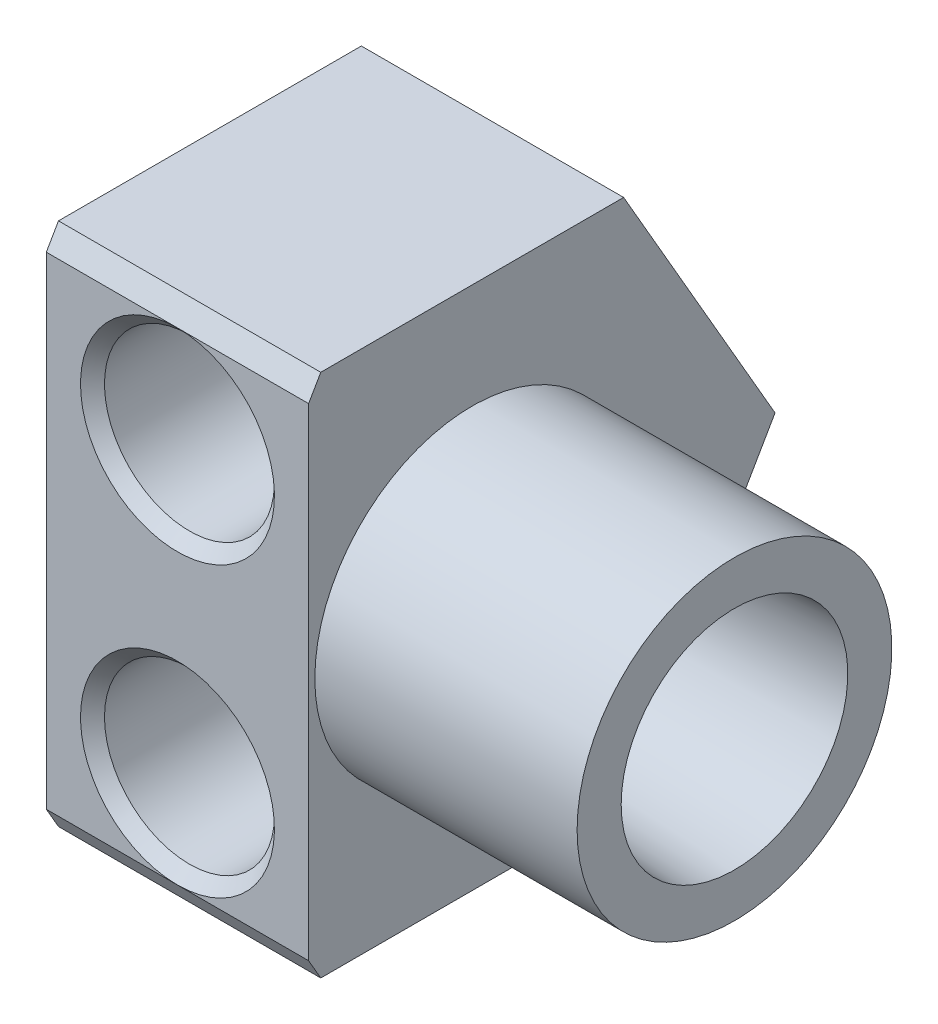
ISO-10303-21;
HEADER;
FILE_DESCRIPTION(('STEP AP214'),'2;1');
FILE_NAME('part.step','',(''),(''),'','','');
FILE_SCHEMA(('AUTOMOTIVE_DESIGN { 1 0 10303 214 1 1 1 1 }'));
ENDSEC;
DATA;
#1=APPLICATION_CONTEXT('core data for automotive mechanical design processes');
#2=APPLICATION_PROTOCOL_DEFINITION('international standard','automotive_design',2000,#1);
#3=PRODUCT_CONTEXT('',#1,'mechanical');
#4=PRODUCT('Part','Part','',(#3));
#5=PRODUCT_RELATED_PRODUCT_CATEGORY('part','',(#4));
#6=PRODUCT_DEFINITION_FORMATION('','',#4);
#7=PRODUCT_DEFINITION_CONTEXT('part definition',#1,'design');
#8=PRODUCT_DEFINITION('design','',#6,#7);
#9=PRODUCT_DEFINITION_SHAPE('','',#8);
#10=(LENGTH_UNIT() NAMED_UNIT(*) SI_UNIT(.MILLI.,.METRE.));
#11=(NAMED_UNIT(*) PLANE_ANGLE_UNIT() SI_UNIT($,.RADIAN.));
#12=(NAMED_UNIT(*) SI_UNIT($,.STERADIAN.) SOLID_ANGLE_UNIT());
#13=UNCERTAINTY_MEASURE_WITH_UNIT(LENGTH_MEASURE(1.E-05),#10,'distance_accuracy_value','');
#14=(GEOMETRIC_REPRESENTATION_CONTEXT(3) GLOBAL_UNCERTAINTY_ASSIGNED_CONTEXT((#13)) GLOBAL_UNIT_ASSIGNED_CONTEXT((#10,
#11,#12)) REPRESENTATION_CONTEXT('',''));
#15=CARTESIAN_POINT('',(0.,0.,0.));
#16=DIRECTION('',(0.,0.,1.));
#17=DIRECTION('',(1.,0.,0.));
#18=AXIS2_PLACEMENT_3D('',#15,#16,#17);
#19=CARTESIAN_POINT('',(21.4376,0.,0.));
#20=DIRECTION('',(1.,0.,0.));
#21=DIRECTION('',(0.,0.,-1.));
#22=AXIS2_PLACEMENT_3D('',#19,#20,#21);
#23=PLANE('',#22);
#24=CARTESIAN_POINT('',(21.4376,0.,0.));
#25=DIRECTION('',(-1.,0.,0.));
#26=DIRECTION('',(0.,0.,1.));
#27=AXIS2_PLACEMENT_3D('',#24,#25,#26);
#28=CIRCLE('',#27,6.31755001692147);
#29=CARTESIAN_POINT('',(21.4376,0.,6.31755001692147));
#30=VERTEX_POINT('',#29);
#31=EDGE_CURVE('E36',#30,#30,#28,.T.);
#32=ORIENTED_EDGE('',*,*,#31,.F.);
#33=EDGE_LOOP('',(#32));
#34=FACE_BOUND('',#33,.T.);
#35=ADVANCED_FACE('F16',(#34),#23,.T.);
#36=CARTESIAN_POINT('',(0.,0.,-4.19801849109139));
#37=DIRECTION('',(0.,0.,1.));
#38=DIRECTION('',(1.,0.,0.));
#39=AXIS2_PLACEMENT_3D('',#36,#37,#38);
#40=PLANE('',#39);
#41=CARTESIAN_POINT('',(7.9375,8.73125,-4.19801849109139));
#42=DIRECTION('',(0.,0.,-1.));
#43=DIRECTION('',(0.,1.,0.));
#44=AXIS2_PLACEMENT_3D('',#41,#42,#43);
#45=CIRCLE('',#44,5.1435);
#46=CARTESIAN_POINT('',(7.9375,13.87475,-4.19801849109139));
#47=VERTEX_POINT('',#46);
#48=EDGE_CURVE('E154',#47,#47,#45,.T.);
#49=ORIENTED_EDGE('',*,*,#48,.F.);
#50=EDGE_LOOP('',(#49));
#51=FACE_BOUND('',#50,.T.);
#52=ADVANCED_FACE('F304',(#51),#40,.T.);
#53=CARTESIAN_POINT('',(5.95591568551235,3.77932766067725,1.73070681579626));
#54=CARTESIAN_POINT('',(6.74855047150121,3.63087026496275,1.73070619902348));
#55=CARTESIAN_POINT('',(7.54118525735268,3.53577356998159,1.73070536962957));
#56=CARTESIAN_POINT('',(8.33382004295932,3.53577439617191,1.73070416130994));
#57=CARTESIAN_POINT('',(9.12645482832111,3.6308718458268,1.73070257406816));
#58=CARTESIAN_POINT('',(9.91908961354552,3.77932968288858,1.73070077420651));
#59=CARTESIAN_POINT('',(5.95591462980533,3.92681016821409,1.03842961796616));
#60=CARTESIAN_POINT('',(6.74854941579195,3.77922035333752,1.03842899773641));
#61=CARTESIAN_POINT('',(7.54118420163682,3.68668609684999,1.0384281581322));
#62=CARTESIAN_POINT('',(8.33381898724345,3.68668661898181,1.03842694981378));
#63=CARTESIAN_POINT('',(9.12645377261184,3.77922156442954,1.03842537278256));
#64=CARTESIAN_POINT('',(9.91908855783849,3.92681155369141,1.03842357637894));
#65=CARTESIAN_POINT('',(5.95591357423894,4.01966553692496,0.346152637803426));
#66=CARTESIAN_POINT('',(6.74854836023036,3.87021078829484,0.346152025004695));
#67=CARTESIAN_POINT('',(7.54118314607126,3.77921913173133,0.346151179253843));
#68=CARTESIAN_POINT('',(8.3338179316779,3.77921911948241,0.346149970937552));
#69=CARTESIAN_POINT('',(9.12645271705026,3.87021114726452,0.346148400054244));
#70=CARTESIAN_POINT('',(9.9190875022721,4.01966636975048,0.346146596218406));
#71=CARTESIAN_POINT('',(5.95591251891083,4.01996875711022,-0.346123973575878));
#72=CARTESIAN_POINT('',(6.74854730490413,3.8697851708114,-0.346124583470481));
#73=CARTESIAN_POINT('',(7.54118209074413,3.77914553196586,-0.346125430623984));
#74=CARTESIAN_POINT('',(8.33381687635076,3.77914577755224,-0.346126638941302));
#75=CARTESIAN_POINT('',(9.12645166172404,3.86978449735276,-0.346128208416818));
#76=CARTESIAN_POINT('',(9.91908644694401,4.01996800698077,-0.346130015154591));
#77=CARTESIAN_POINT('',(5.95591146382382,3.92663167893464,-1.03840021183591));
#78=CARTESIAN_POINT('',(6.74854624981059,3.77898481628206,-1.03840083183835));
#79=CARTESIAN_POINT('',(7.5411810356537,3.68713374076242,-1.03840167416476));
#80=CARTESIAN_POINT('',(8.33381582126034,3.6871334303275,-1.03840288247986));
#81=CARTESIAN_POINT('',(9.12645060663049,3.77898388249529,-1.03840445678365));
#82=CARTESIAN_POINT('',(9.91908539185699,3.92663012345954,-1.03840625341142));
#83=CARTESIAN_POINT('',(5.95591040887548,3.77943158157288,-1.73067623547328));
#84=CARTESIAN_POINT('',(6.74854519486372,3.63121310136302,-1.73067685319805));
#85=CARTESIAN_POINT('',(7.54117998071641,3.53564380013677,-1.73067768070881));
#86=CARTESIAN_POINT('',(8.33381476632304,3.53564268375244,-1.7306788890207));
#87=CARTESIAN_POINT('',(9.12644955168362,3.63121167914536,-1.7306804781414));
#88=CARTESIAN_POINT('',(9.91908433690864,3.77942957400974,-1.73068227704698));
#89=CARTESIAN_POINT('',(5.955910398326,3.77795958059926,-1.73759899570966));
#90=CARTESIAN_POINT('',(6.74854518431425,3.62973538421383,-1.73759961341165));
#91=CARTESIAN_POINT('',(7.54117997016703,3.53412890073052,-1.73760044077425));
#92=CARTESIAN_POINT('',(8.33381475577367,3.53412777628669,-1.73760164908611));
#93=CARTESIAN_POINT('',(9.12644954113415,3.62973395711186,-1.73760323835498));
#94=CARTESIAN_POINT('',(9.91908432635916,3.77795756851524,-1.73760503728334));
#95=CARTESIAN_POINT('',(5.95591038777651,3.77648757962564,-1.74452175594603));
#96=CARTESIAN_POINT('',(6.74854517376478,3.62825766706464,-1.74452237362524));
#97=CARTESIAN_POINT('',(7.54117995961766,3.53261400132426,-1.74452320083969));
#98=CARTESIAN_POINT('',(8.3338147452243,3.53261286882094,-1.74452440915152));
#99=CARTESIAN_POINT('',(9.12644953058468,3.62825623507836,-1.74452599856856));
#100=CARTESIAN_POINT('',(9.91908431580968,3.77648556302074,-1.74452779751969));
#101=CARTESIAN_POINT('',(5.95591037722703,3.77501557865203,-1.75144451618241));
#102=CARTESIAN_POINT('',(6.74854516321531,3.62677994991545,-1.75144513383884));
#103=CARTESIAN_POINT('',(7.54117994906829,3.53109910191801,-1.75144596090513));
#104=CARTESIAN_POINT('',(8.33381473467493,3.53109796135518,-1.75144716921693));
#105=CARTESIAN_POINT('',(9.12644952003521,3.62677851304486,-1.75144875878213));
#106=CARTESIAN_POINT('',(9.9190843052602,3.77501355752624,-1.75145055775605));
#107=CARTESIAN_POINT('',(5.95591036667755,3.77354357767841,-1.75836727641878));
#108=CARTESIAN_POINT('',(6.74854515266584,3.62530223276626,-1.75836789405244));
#109=CARTESIAN_POINT('',(7.54117993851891,3.52958420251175,-1.75836872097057));
#110=CARTESIAN_POINT('',(8.33381472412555,3.52958305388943,-1.75836992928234));
#111=CARTESIAN_POINT('',(9.12644950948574,3.62530079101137,-1.75837151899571));
#112=CARTESIAN_POINT('',(9.91908429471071,3.77354155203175,-1.75837331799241));
#113=CARTESIAN_POINT('',(5.95591035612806,3.77207157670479,-1.76529003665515));
#114=CARTESIAN_POINT('',(6.74854514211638,3.62382451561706,-1.76529065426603));
#115=CARTESIAN_POINT('',(7.54117992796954,3.52806930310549,-1.76529148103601));
#116=CARTESIAN_POINT('',(8.33381471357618,3.52806814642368,-1.76529268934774));
#117=CARTESIAN_POINT('',(9.12644949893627,3.62382306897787,-1.76529427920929));
#118=CARTESIAN_POINT('',(9.91908428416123,3.77206954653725,-1.76529607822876));
#119=B_SPLINE_SURFACE_WITH_KNOTS('',5,5,((#53,#54,#55,#56,#57,#58),(#59,#60,#61,#62,#63,#64),
(#65,#66,#67,#68,#69,#70),(#71,#72,#73,#74,#75,#76),(#77,#78,#79,#80,#81,#82),(#83,#84,#85,#86,
#87,#88),(#89,#90,#91,#92,#93,#94),(#95,#96,#97,#98,#99,#100),(#101,#102,#103,#104,#105,#106),
(#107,#108,#109,#110,#111,#112),(#113,#114,#115,#116,#117,#118)),.UNSPECIFIED.,.F.,.F.,.F.,(6,5,
6),(6,6),(-1.73070258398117,1.73068046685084,1.76529429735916),(-1.98158674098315,
1.98158718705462),.UNSPECIFIED.);
#120=CARTESIAN_POINT('',(7.93749999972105,3.58774999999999,1.69796964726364));
#121=CARTESIAN_POINT('',(7.8276041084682,3.58775328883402,1.69797085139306));
#122=CARTESIAN_POINT('',(7.71759706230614,3.59129903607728,1.69062056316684));
#123=CARTESIAN_POINT('',(7.49990137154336,3.60523482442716,1.66094505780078));
#124=CARTESIAN_POINT('',(7.39221704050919,3.61563662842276,1.63859410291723));
#125=CARTESIAN_POINT('',(7.18174427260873,3.64246886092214,1.57821239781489));
#126=CARTESIAN_POINT('',(7.07896914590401,3.65891473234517,1.54014145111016));
#127=CARTESIAN_POINT('',(6.88183063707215,3.69625097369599,1.44783662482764));
#128=CARTESIAN_POINT('',(6.78746213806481,3.71713861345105,1.39361266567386));
#129=CARTESIAN_POINT('',(6.61021098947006,3.76111275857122,1.26899342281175));
#130=CARTESIAN_POINT('',(6.52735756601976,3.78420461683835,1.19855815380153));
#131=CARTESIAN_POINT('',(6.37674543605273,3.82963354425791,1.04278225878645));
#132=CARTESIAN_POINT('',(6.30898278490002,3.85197080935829,0.957445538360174));
#133=CARTESIAN_POINT('',(6.19806609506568,3.89048201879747,0.784412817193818));
#134=CARTESIAN_POINT('',(6.1530198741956,3.90706430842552,0.698020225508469));
#135=CARTESIAN_POINT('',(6.07911099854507,3.93504726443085,0.517804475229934));
#136=CARTESIAN_POINT('',(6.0502333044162,3.94645274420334,0.42398831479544));
#137=CARTESIAN_POINT('',(6.01198385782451,3.96172570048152,0.241385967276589));
#138=CARTESIAN_POINT('',(6.00099866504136,3.96621439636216,0.152988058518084));
#139=CARTESIAN_POINT('',(5.99386589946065,3.96911823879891,-0.024488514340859));
#140=CARTESIAN_POINT('',(5.99771203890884,3.96753595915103,-0.113566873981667));
#141=CARTESIAN_POINT('',(6.01940420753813,3.95876439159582,-0.28442375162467));
#142=CARTESIAN_POINT('',(6.03642641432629,3.95190518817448,-0.366326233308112));
#143=CARTESIAN_POINT('',(6.08279743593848,3.93372086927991,-0.526033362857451));
#144=CARTESIAN_POINT('',(6.11214824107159,3.92239503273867,-0.603837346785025));
#145=CARTESIAN_POINT('',(6.18319986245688,3.89601548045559,-0.755729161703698));
#146=CARTESIAN_POINT('',(6.22523661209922,3.88086246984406,-0.829641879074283));
#147=CARTESIAN_POINT('',(6.32001345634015,3.84843998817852,-0.969713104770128));
#148=CARTESIAN_POINT('',(6.37275597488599,3.83117003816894,-1.03586985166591));
#149=CARTESIAN_POINT('',(6.4923307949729,3.79452080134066,-1.16447822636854));
#150=CARTESIAN_POINT('',(6.55997055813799,3.77508560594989,-1.22616283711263));
#151=CARTESIAN_POINT('',(6.70423875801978,3.73723143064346,-1.33827031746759));
#152=CARTESIAN_POINT('',(6.78086963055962,3.71881272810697,-1.38869012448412));
#153=CARTESIAN_POINT('',(6.9482772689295,3.68298479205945,-1.48192977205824));
#154=CARTESIAN_POINT('',(7.03970619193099,3.66581278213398,-1.52366809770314));
#155=CARTESIAN_POINT('',(7.22829588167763,3.635982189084,-1.59358427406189));
#156=CARTESIAN_POINT('',(7.32545976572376,3.62332608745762,-1.62175467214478));
#157=CARTESIAN_POINT('',(7.53409392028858,3.60240906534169,-1.66742291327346));
#158=CARTESIAN_POINT('',(7.64596060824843,3.59478637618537,-1.68340210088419));
#159=CARTESIAN_POINT('',(7.87112661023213,3.58694188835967,-1.69983389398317));
#160=CARTESIAN_POINT('',(7.98442692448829,3.58672557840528,-1.70027498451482));
#161=CARTESIAN_POINT('',(8.22057273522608,3.59406349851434,-1.68492825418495));
#162=CARTESIAN_POINT('',(8.34330041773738,3.60235923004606,-1.66759189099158));
#163=CARTESIAN_POINT('',(8.58359171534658,3.627062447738,-1.61353095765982));
#164=CARTESIAN_POINT('',(8.701157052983,3.64346720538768,-1.57681290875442));
#165=CARTESIAN_POINT('',(8.92316704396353,3.68186119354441,-1.48464081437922));
#166=CARTESIAN_POINT('',(9.02791610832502,3.70364894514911,-1.42984290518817));
#167=CARTESIAN_POINT('',(9.22431107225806,3.75029671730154,-1.30127494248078));
#168=CARTESIAN_POINT('',(9.31596623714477,3.77515454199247,-1.22751840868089));
#169=CARTESIAN_POINT('',(9.47205670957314,3.82140582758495,-1.07240096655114));
#170=CARTESIAN_POINT('',(9.53843847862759,3.84285710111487,-0.993014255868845));
#171=CARTESIAN_POINT('',(9.65526337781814,3.88267278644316,-0.822562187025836));
#172=CARTESIAN_POINT('',(9.70571738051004,3.90103929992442,-0.731504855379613));
#173=CARTESIAN_POINT('',(9.78404095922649,3.93047374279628,-0.550547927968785));
#174=CARTESIAN_POINT('',(9.81372048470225,3.94210405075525,-0.461522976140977));
#175=CARTESIAN_POINT('',(9.85710455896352,3.95932481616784,-0.279124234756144));
#176=CARTESIAN_POINT('',(9.87082305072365,3.96492054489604,-0.18575431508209));
#177=CARTESIAN_POINT('',(9.88114399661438,3.96912222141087,-0.00631740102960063));
#178=CARTESIAN_POINT('',(9.87916489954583,3.96830748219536,0.0796575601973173));
#179=CARTESIAN_POINT('',(9.861523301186,3.96115398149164,0.249950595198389));
#180=CARTESIAN_POINT('',(9.84586142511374,3.95481547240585,0.334268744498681));
#181=CARTESIAN_POINT('',(9.80197601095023,3.93751904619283,0.497113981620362));
#182=CARTESIAN_POINT('',(9.77402387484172,3.92666119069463,0.575725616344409));
#183=CARTESIAN_POINT('',(9.70659765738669,3.90142848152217,0.72721938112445));
#184=CARTESIAN_POINT('',(9.66712131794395,3.88705293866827,0.800100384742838));
#185=CARTESIAN_POINT('',(9.575112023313,3.8551530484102,0.942835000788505));
#186=CARTESIAN_POINT('',(9.521936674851,3.83749133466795,1.0122430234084));
#187=CARTESIAN_POINT('',(9.40548599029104,3.80130850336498,1.14169326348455));
#188=CARTESIAN_POINT('',(9.3422092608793,3.78278726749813,1.20173418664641));
#189=CARTESIAN_POINT('',(9.20141406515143,3.74488246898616,1.31639044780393));
#190=CARTESIAN_POINT('',(9.12313913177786,3.7255615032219,1.37009665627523));
#191=CARTESIAN_POINT('',(8.95884795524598,3.68947229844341,1.46515712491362));
#192=CARTESIAN_POINT('',(8.87282518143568,3.6727062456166,1.50650083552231));
#193=CARTESIAN_POINT('',(8.68636540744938,3.64159432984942,1.58045539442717));
#194=CARTESIAN_POINT('',(8.58534857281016,3.62766092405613,1.61177134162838));
#195=CARTESIAN_POINT('',(8.37944973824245,3.605728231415,1.66003081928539));
#196=CARTESIAN_POINT('',(8.27457266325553,3.59772164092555,1.67699204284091));
#197=CARTESIAN_POINT('',(8.13054403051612,3.59122872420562,1.69067889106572));
#198=CARTESIAN_POINT('',(8.0919995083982,3.58992600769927,1.69341388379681));
#199=CARTESIAN_POINT('',(8.01480790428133,3.58818609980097,1.69705898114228));
#200=CARTESIAN_POINT('',(7.97616083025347,3.58774884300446,1.69796922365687));
#201=CARTESIAN_POINT('',(7.93749999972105,3.58774999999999,1.69796964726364));
#202=B_SPLINE_CURVE_WITH_KNOTS('',3,(#120,#121,#122,#123,#124,#125,#126,#127,#128,#129,#130,
#131,#132,#133,#134,#135,#136,#137,#138,#139,#140,#141,#142,#143,#144,#145,#146,#147,#148,#149,
#150,#151,#152,#153,#154,#155,#156,#157,#158,#159,#160,#161,#162,#163,#164,#165,#166,#167,#168,
#169,#170,#171,#172,#173,#174,#175,#176,#177,#178,#179,#180,#181,#182,#183,#184,#185,#186,#187,
#188,#189,#190,#191,#192,#193,#194,#195,#196,#197,#198,#199,#200,#201),.UNSPECIFIED.,.T.,.F.,(4,
2,2,2,2,2,2,2,2,2,2,2,2,2,2,2,2,2,2,2,2,2,2,2,2,2,2,2,2,2,2,2,2,2,2,2,2,2,2,2,4),(0.,
0.329572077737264,0.65971107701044,0.990699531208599,1.32148512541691,1.6530955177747,
1.98461912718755,2.27949803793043,2.5741022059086,2.8402763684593,3.10633769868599,
3.35698790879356,3.60767859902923,3.86569744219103,4.12377476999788,4.40333812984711,
4.68297740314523,4.98760135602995,5.29239244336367,5.63077940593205,5.96941713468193,
6.34028388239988,6.7110259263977,7.06957094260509,7.4278609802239,7.7431621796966,
8.05824768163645,8.34038457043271,8.62227480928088,8.87900407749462,9.13572161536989,
9.3870344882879,9.63839663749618,9.90487410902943,10.1713883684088,10.4607969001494,
10.7504516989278,11.0692111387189,11.3875771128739,11.5035277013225,11.6194695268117),.UNSPECIFIED.);
#203=CARTESIAN_POINT('',(7.93749999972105,3.58775,1.69796964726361));
#204=VERTEX_POINT('',#203);
#205=EDGE_CURVE('E19',#204,#204,#202,.T.);
#206=ORIENTED_EDGE('',*,*,#205,.F.);
#207=EDGE_LOOP('',(#206));
#208=FACE_BOUND('',#207,.T.);
#209=ADVANCED_FACE('F299',(#208),#119,.F.);
#210=CARTESIAN_POINT('',(0.,0.,-4.1980184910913));
#211=DIRECTION('',(0.,0.,1.));
#212=DIRECTION('',(1.,0.,0.));
#213=AXIS2_PLACEMENT_3D('',#210,#211,#212);
#214=PLANE('',#213);
#215=CARTESIAN_POINT('',(7.9375,-8.73125,-4.1980184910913));
#216=DIRECTION('',(0.,0.,-1.));
#217=DIRECTION('',(0.,1.,0.));
#218=AXIS2_PLACEMENT_3D('',#215,#216,#217);
#219=CIRCLE('',#218,5.14349999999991);
#220=CARTESIAN_POINT('',(7.9375,-3.58775000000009,-4.1980184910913));
#221=VERTEX_POINT('',#220);
#222=EDGE_CURVE('E30',#221,#221,#219,.T.);
#223=ORIENTED_EDGE('',*,*,#222,.F.);
#224=EDGE_LOOP('',(#223));
#225=FACE_BOUND('',#224,.T.);
#226=ADVANCED_FACE('F263',(#225),#214,.T.);
#227=CARTESIAN_POINT('',(5.9559156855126,-3.77932766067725,1.73070681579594));
#228=CARTESIAN_POINT('',(6.74855047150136,-3.63087026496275,1.73070619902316));
#229=CARTESIAN_POINT('',(7.54118525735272,-3.53577356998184,1.73070536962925));
#230=CARTESIAN_POINT('',(8.33382004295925,-3.53577439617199,1.73070416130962));
#231=CARTESIAN_POINT('',(9.12645482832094,-3.63087184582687,1.73070257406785));
#232=CARTESIAN_POINT('',(9.91908961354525,-3.77932968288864,1.73070077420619));
#233=CARTESIAN_POINT('',(5.95591462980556,-3.92681016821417,1.03842961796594));
#234=CARTESIAN_POINT('',(6.74854941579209,-3.77922035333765,1.03842899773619));
#235=CARTESIAN_POINT('',(7.54118420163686,-3.68668609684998,1.03842815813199));
#236=CARTESIAN_POINT('',(8.33381898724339,-3.68668661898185,1.03842694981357));
#237=CARTESIAN_POINT('',(9.12645377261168,-3.77922156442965,1.03842537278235));
#238=CARTESIAN_POINT('',(9.91908855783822,-3.92681155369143,1.03842357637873));
#239=CARTESIAN_POINT('',(5.95591357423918,-4.0196655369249,0.346152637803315));
#240=CARTESIAN_POINT('',(6.7485483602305,-3.87021078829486,0.346152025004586));
#241=CARTESIAN_POINT('',(7.5411831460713,-3.77921913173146,0.346151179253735));
#242=CARTESIAN_POINT('',(8.33381793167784,-3.77921911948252,0.346149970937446));
#243=CARTESIAN_POINT('',(9.1264527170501,-3.87021114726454,0.346148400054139));
#244=CARTESIAN_POINT('',(9.91908750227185,-4.01966636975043,0.346146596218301));
#245=CARTESIAN_POINT('',(5.95591251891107,-4.01996875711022,-0.346123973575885));
#246=CARTESIAN_POINT('',(6.74854730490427,-3.86978517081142,-0.346124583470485));
#247=CARTESIAN_POINT('',(7.54118209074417,-3.7791455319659,-0.346125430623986));
#248=CARTESIAN_POINT('',(8.3338168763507,-3.77914577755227,-0.346126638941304));
#249=CARTESIAN_POINT('',(9.12645166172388,-3.86978449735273,-0.346128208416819));
#250=CARTESIAN_POINT('',(9.91908644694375,-4.01996800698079,-0.346130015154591));
#251=CARTESIAN_POINT('',(5.95591146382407,-3.92663167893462,-1.03840021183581));
#252=CARTESIAN_POINT('',(6.74854624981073,-3.77898481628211,-1.03840083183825));
#253=CARTESIAN_POINT('',(7.54118103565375,-3.68713374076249,-1.03840167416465));
#254=CARTESIAN_POINT('',(8.33381582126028,-3.68713343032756,-1.03840288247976));
#255=CARTESIAN_POINT('',(9.12645060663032,-3.77898388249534,-1.03840445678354));
#256=CARTESIAN_POINT('',(9.91908539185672,-3.92663012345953,-1.03840625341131));
#257=CARTESIAN_POINT('',(5.95591040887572,-3.7794315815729,-1.73067623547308));
#258=CARTESIAN_POINT('',(6.74854519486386,-3.6312131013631,-1.73067685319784));
#259=CARTESIAN_POINT('',(7.54117998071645,-3.53564380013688,-1.7306776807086));
#260=CARTESIAN_POINT('',(8.33381476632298,-3.53564268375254,-1.73067888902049));
#261=CARTESIAN_POINT('',(9.12644955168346,-3.63121167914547,-1.73068047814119));
#262=CARTESIAN_POINT('',(9.91908433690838,-3.77942957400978,-1.73068227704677));
#263=CARTESIAN_POINT('',(5.95591039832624,-3.77795958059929,-1.73759899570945));
#264=CARTESIAN_POINT('',(6.74854518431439,-3.62973538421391,-1.73759961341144));
#265=CARTESIAN_POINT('',(7.54117997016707,-3.53412890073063,-1.73760044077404));
#266=CARTESIAN_POINT('',(8.33381475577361,-3.53412777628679,-1.7376016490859));
#267=CARTESIAN_POINT('',(9.12644954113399,-3.62973395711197,-1.73760323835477));
#268=CARTESIAN_POINT('',(9.9190843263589,-3.77795756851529,-1.73760503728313));
#269=CARTESIAN_POINT('',(5.95591038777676,-3.77648757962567,-1.74452175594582));
#270=CARTESIAN_POINT('',(6.74854517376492,-3.62825766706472,-1.74452237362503));
#271=CARTESIAN_POINT('',(7.5411799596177,-3.53261400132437,-1.74452320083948));
#272=CARTESIAN_POINT('',(8.33381474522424,-3.53261286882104,-1.74452440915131));
#273=CARTESIAN_POINT('',(9.12644953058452,-3.62825623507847,-1.74452599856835));
#274=CARTESIAN_POINT('',(9.91908431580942,-3.77648556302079,-1.74452779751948));
#275=CARTESIAN_POINT('',(5.95591037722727,-3.77501557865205,-1.75144451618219));
#276=CARTESIAN_POINT('',(6.74854516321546,-3.62677994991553,-1.75144513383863));
#277=CARTESIAN_POINT('',(7.54117994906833,-3.53109910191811,-1.75144596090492));
#278=CARTESIAN_POINT('',(8.33381473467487,-3.53109796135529,-1.75144716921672));
#279=CARTESIAN_POINT('',(9.12644952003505,-3.62677851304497,-1.75144875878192));
#280=CARTESIAN_POINT('',(9.91908430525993,-3.77501355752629,-1.75145055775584));
#281=CARTESIAN_POINT('',(5.95591036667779,-3.77354357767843,-1.75836727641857));
#282=CARTESIAN_POINT('',(6.74854515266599,-3.62530223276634,-1.75836789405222));
#283=CARTESIAN_POINT('',(7.54117993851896,-3.52958420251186,-1.75836872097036));
#284=CARTESIAN_POINT('',(8.33381472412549,-3.52958305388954,-1.75836992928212));
#285=CARTESIAN_POINT('',(9.12644950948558,-3.62530079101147,-1.7583715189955));
#286=CARTESIAN_POINT('',(9.91908429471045,-3.77354155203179,-1.75837331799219));
#287=CARTESIAN_POINT('',(5.95591035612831,-3.77207157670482,-1.76529003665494));
#288=CARTESIAN_POINT('',(6.74854514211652,-3.62382451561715,-1.76529065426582));
#289=CARTESIAN_POINT('',(7.54117992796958,-3.5280693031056,-1.7652914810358));
#290=CARTESIAN_POINT('',(8.33381471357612,-3.52806814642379,-1.76529268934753));
#291=CARTESIAN_POINT('',(9.12644949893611,-3.62382306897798,-1.76529427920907));
#292=CARTESIAN_POINT('',(9.91908428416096,-3.7720695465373,-1.76529607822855));
#293=B_SPLINE_SURFACE_WITH_KNOTS('',5,5,((#227,#228,#229,#230,#231,#232),(#233,#234,#235,#236,
#237,#238),(#239,#240,#241,#242,#243,#244),(#245,#246,#247,#248,#249,#250),(#251,#252,#253,#254,
#255,#256),(#257,#258,#259,#260,#261,#262),(#263,#264,#265,#266,#267,#268),(#269,#270,#271,#272,
#273,#274),(#275,#276,#277,#278,#279,#280),(#281,#282,#283,#284,#285,#286),(#287,#288,#289,#290,
#291,#292)),.UNSPECIFIED.,.F.,.F.,.F.,(6,5,6),(6,6),(-1.73070258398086,1.73068046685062,
1.76529429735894),(-1.9815867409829,1.98158718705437),.UNSPECIFIED.);
#294=CARTESIAN_POINT('',(7.93749999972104,-3.58775000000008,1.69796964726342));
#295=CARTESIAN_POINT('',(7.82760410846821,-3.58775328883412,1.69797085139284));
#296=CARTESIAN_POINT('',(7.71759706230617,-3.59129903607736,1.69062056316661));
#297=CARTESIAN_POINT('',(7.49990137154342,-3.60523482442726,1.66094505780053));
#298=CARTESIAN_POINT('',(7.39221704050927,-3.61563662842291,1.63859410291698));
#299=CARTESIAN_POINT('',(7.18174427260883,-3.64246886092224,1.57821239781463));
#300=CARTESIAN_POINT('',(7.07896914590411,-3.65891473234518,1.54014145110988));
#301=CARTESIAN_POINT('',(6.88183063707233,-3.69625097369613,1.44783662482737));
#302=CARTESIAN_POINT('',(6.78746213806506,-3.71713861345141,1.39361266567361));
#303=CARTESIAN_POINT('',(6.61021098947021,-3.76111275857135,1.26899342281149));
#304=CARTESIAN_POINT('',(6.52735756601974,-3.78420461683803,1.19855815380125));
#305=CARTESIAN_POINT('',(6.37674543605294,-3.82963354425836,1.04278225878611));
#306=CARTESIAN_POINT('',(6.30898278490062,-3.85197080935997,0.957445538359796));
#307=CARTESIAN_POINT('',(6.19806609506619,-3.89048201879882,0.784412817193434));
#308=CARTESIAN_POINT('',(6.15301987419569,-3.90706430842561,0.69802022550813));
#309=CARTESIAN_POINT('',(6.07911099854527,-3.93504726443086,0.51780447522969));
#310=CARTESIAN_POINT('',(6.0502333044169,-3.94645274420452,0.423988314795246));
#311=CARTESIAN_POINT('',(6.01198385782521,-3.96172570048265,0.241385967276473));
#312=CARTESIAN_POINT('',(6.00099866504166,-3.96621439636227,0.152988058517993));
#313=CARTESIAN_POINT('',(5.99386589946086,-3.96911823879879,-0.0244885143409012));
#314=CARTESIAN_POINT('',(5.99771203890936,-3.96753595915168,-0.113566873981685));
#315=CARTESIAN_POINT('',(6.01940420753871,-3.95876439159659,-0.284423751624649));
#316=CARTESIAN_POINT('',(6.03642641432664,-3.95190518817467,-0.366326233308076));
#317=CARTESIAN_POINT('',(6.08279743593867,-3.93372086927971,-0.526033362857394));
#318=CARTESIAN_POINT('',(6.11214824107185,-3.92239503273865,-0.603837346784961));
#319=CARTESIAN_POINT('',(6.18319986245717,-3.89601548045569,-0.75572916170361));
#320=CARTESIAN_POINT('',(6.22523661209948,-3.8808624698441,-0.829641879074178));
#321=CARTESIAN_POINT('',(6.32001345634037,-3.84843998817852,-0.969713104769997));
#322=CARTESIAN_POINT('',(6.37275597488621,-3.83117003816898,-1.03586985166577));
#323=CARTESIAN_POINT('',(6.4923307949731,-3.79452080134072,-1.16447822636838));
#324=CARTESIAN_POINT('',(6.55997055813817,-3.77508560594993,-1.22616283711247));
#325=CARTESIAN_POINT('',(6.70423875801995,-3.73723143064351,-1.33827031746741));
#326=CARTESIAN_POINT('',(6.7808696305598,-3.71881272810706,-1.38869012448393));
#327=CARTESIAN_POINT('',(6.94827726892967,-3.68298479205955,-1.48192977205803));
#328=CARTESIAN_POINT('',(7.03970619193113,-3.66581278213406,-1.52366809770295));
#329=CARTESIAN_POINT('',(7.22829588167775,-3.63598218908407,-1.5935842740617));
#330=CARTESIAN_POINT('',(7.32545976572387,-3.62332608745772,-1.6217546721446));
#331=CARTESIAN_POINT('',(7.53409392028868,-3.6024090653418,-1.66742291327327));
#332=CARTESIAN_POINT('',(7.64596060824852,-3.59478637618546,-1.683402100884));
#333=CARTESIAN_POINT('',(7.87112661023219,-3.58694188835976,-1.69983389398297));
#334=CARTESIAN_POINT('',(7.98442692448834,-3.5867255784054,-1.70027498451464));
#335=CARTESIAN_POINT('',(8.22057273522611,-3.59406349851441,-1.68492825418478));
#336=CARTESIAN_POINT('',(8.3433004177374,-3.60235923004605,-1.66759189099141));
#337=CARTESIAN_POINT('',(8.58359171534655,-3.62706244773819,-1.61353095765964));
#338=CARTESIAN_POINT('',(8.70115705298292,-3.64346720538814,-1.57681290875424));
#339=CARTESIAN_POINT('',(8.92316704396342,-3.68186119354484,-1.48464081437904));
#340=CARTESIAN_POINT('',(9.02791610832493,-3.70364894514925,-1.429842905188));
#341=CARTESIAN_POINT('',(9.22431107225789,-3.75029671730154,-1.30127494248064));
#342=CARTESIAN_POINT('',(9.31596623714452,-3.7751545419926,-1.22751840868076));
#343=CARTESIAN_POINT('',(9.47205670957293,-3.8214058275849,-1.07240096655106));
#344=CARTESIAN_POINT('',(9.53843847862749,-3.84285710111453,-0.993014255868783));
#345=CARTESIAN_POINT('',(9.65526337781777,-3.88267278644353,-0.82256218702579));
#346=CARTESIAN_POINT('',(9.70571738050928,-3.90103929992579,-0.731504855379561));
#347=CARTESIAN_POINT('',(9.78404095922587,-3.93047374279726,-0.550547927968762));
#348=CARTESIAN_POINT('',(9.81372048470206,-3.94210405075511,-0.46152297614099));
#349=CARTESIAN_POINT('',(9.8571045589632,-3.95932481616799,-0.279124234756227));
#350=CARTESIAN_POINT('',(9.87082305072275,-3.96492054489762,-0.185754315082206));
#351=CARTESIAN_POINT('',(9.88114399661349,-3.96912222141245,-0.00631740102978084));
#352=CARTESIAN_POINT('',(9.87916489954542,-3.96830748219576,0.0796575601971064));
#353=CARTESIAN_POINT('',(9.86152330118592,-3.96115398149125,0.24995059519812));
#354=CARTESIAN_POINT('',(9.84586142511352,-3.95481547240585,0.334268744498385));
#355=CARTESIAN_POINT('',(9.80197601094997,-3.93751904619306,0.497113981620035));
#356=CARTESIAN_POINT('',(9.77402387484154,-3.92666119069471,0.575725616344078));
#357=CARTESIAN_POINT('',(9.70659765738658,-3.90142848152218,0.72721938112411));
#358=CARTESIAN_POINT('',(9.66712131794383,-3.88705293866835,0.800100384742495));
#359=CARTESIAN_POINT('',(9.57511202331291,-3.85515304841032,0.942835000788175));
#360=CARTESIAN_POINT('',(9.52193667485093,-3.83749133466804,1.01224302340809));
#361=CARTESIAN_POINT('',(9.40548599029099,-3.80130850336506,1.14169326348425));
#362=CARTESIAN_POINT('',(9.34220926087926,-3.78278726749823,1.20173418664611));
#363=CARTESIAN_POINT('',(9.20141406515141,-3.74488246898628,1.31639044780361));
#364=CARTESIAN_POINT('',(9.12313913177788,-3.725561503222,1.37009665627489));
#365=CARTESIAN_POINT('',(8.95884795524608,-3.68947229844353,1.46515712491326));
#366=CARTESIAN_POINT('',(8.87282518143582,-3.67270624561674,1.50650083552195));
#367=CARTESIAN_POINT('',(8.68636540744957,-3.64159432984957,1.58045539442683));
#368=CARTESIAN_POINT('',(8.58534857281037,-3.62766092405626,1.61177134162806));
#369=CARTESIAN_POINT('',(8.37944973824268,-3.6057282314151,1.6600308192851));
#370=CARTESIAN_POINT('',(8.27457266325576,-3.59772164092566,1.67699204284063));
#371=CARTESIAN_POINT('',(8.13054403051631,-3.59122872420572,1.69067889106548));
#372=CARTESIAN_POINT('',(8.09199950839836,-3.58992600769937,1.69341388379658));
#373=CARTESIAN_POINT('',(8.0148079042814,-3.58818609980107,1.69705898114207));
#374=CARTESIAN_POINT('',(7.9761608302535,-3.58774884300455,1.69796922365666));
#375=CARTESIAN_POINT('',(7.93749999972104,-3.58775000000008,1.69796964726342));
#376=B_SPLINE_CURVE_WITH_KNOTS('',3,(#294,#295,#296,#297,#298,#299,#300,#301,#302,#303,#304,
#305,#306,#307,#308,#309,#310,#311,#312,#313,#314,#315,#316,#317,#318,#319,#320,#321,#322,#323,
#324,#325,#326,#327,#328,#329,#330,#331,#332,#333,#334,#335,#336,#337,#338,#339,#340,#341,#342,
#343,#344,#345,#346,#347,#348,#349,#350,#351,#352,#353,#354,#355,#356,#357,#358,#359,#360,#361,
#362,#363,#364,#365,#366,#367,#368,#369,#370,#371,#372,#373,#374,#375),.UNSPECIFIED.,.T.,.F.,(4,
2,2,2,2,2,2,2,2,2,2,2,2,2,2,2,2,2,2,2,2,2,2,2,2,2,2,2,2,2,2,2,2,2,2,2,2,2,2,2,4),(0.,
0.329572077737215,0.659711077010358,0.990699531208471,1.32148512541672,1.65309551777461,
1.98461912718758,2.27949803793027,2.57410220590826,2.84027636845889,3.1063376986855,
3.35698790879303,3.60767859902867,3.86569744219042,4.12377476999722,4.40333812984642,
4.68297740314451,4.9876013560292,5.29239244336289,5.63077940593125,5.96941713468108,
6.34028388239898,6.7110259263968,7.06957094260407,7.42786098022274,7.74316217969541,
8.05824768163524,8.3403845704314,8.62227480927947,8.87900407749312,9.1357216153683,
9.38703448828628,9.63839663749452,9.90487410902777,10.1713883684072,10.4607969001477,
10.7504516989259,11.0692111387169,11.387577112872,11.5035277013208,11.6194695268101),.UNSPECIFIED.);
#377=CARTESIAN_POINT('',(7.93749999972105,-3.58775000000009,1.69796964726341));
#378=VERTEX_POINT('',#377);
#379=EDGE_CURVE('E11',#378,#378,#376,.T.);
#380=ORIENTED_EDGE('',*,*,#379,.T.);
#381=EDGE_LOOP('',(#380));
#382=FACE_BOUND('',#381,.T.);
#383=ADVANCED_FACE('F195',(#382),#293,.T.);
#384=CARTESIAN_POINT('',(31.75,0.,0.));
#385=DIRECTION('',(1.,0.,0.));
#386=DIRECTION('',(0.,0.,-1.));
#387=AXIS2_PLACEMENT_3D('',#384,#385,#386);
#388=CONICAL_SURFACE('',#387,6.858,0.052359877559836);
#389=ORIENTED_EDGE('',*,*,#31,.T.);
#390=EDGE_LOOP('',(#389));
#391=FACE_BOUND('',#390,.T.);
#392=CARTESIAN_POINT('',(31.75,0.,0.));
#393=DIRECTION('',(-1.,0.,0.));
#394=DIRECTION('',(0.,0.,1.));
#395=AXIS2_PLACEMENT_3D('',#392,#393,#394);
#396=CIRCLE('',#395,6.858);
#397=CARTESIAN_POINT('',(31.75,0.,6.858));
#398=VERTEX_POINT('',#397);
#399=EDGE_CURVE('E267',#398,#398,#396,.T.);
#400=ORIENTED_EDGE('',*,*,#399,.F.);
#401=EDGE_LOOP('',(#400));
#402=FACE_BOUND('',#401,.T.);
#403=ADVANCED_FACE('F254',(#391,#402),#388,.F.);
#404=CARTESIAN_POINT('',(31.75,-9.525,0.));
#405=DIRECTION('',(1.,0.,0.));
#406=DIRECTION('',(0.,0.,-1.));
#407=AXIS2_PLACEMENT_3D('',#404,#405,#406);
#408=PLANE('',#407);
#409=CARTESIAN_POINT('',(31.75,0.,0.));
#410=DIRECTION('',(-1.,0.,0.));
#411=DIRECTION('',(0.,0.,1.));
#412=AXIS2_PLACEMENT_3D('',#409,#410,#411);
#413=CIRCLE('',#412,9.525);
#414=CARTESIAN_POINT('',(31.75,0.,9.525));
#415=VERTEX_POINT('',#414);
#416=EDGE_CURVE('E269',#415,#415,#413,.T.);
#417=ORIENTED_EDGE('',*,*,#416,.F.);
#418=EDGE_LOOP('',(#417));
#419=FACE_BOUND('',#418,.T.);
#420=ORIENTED_EDGE('',*,*,#399,.T.);
#421=EDGE_LOOP('',(#420));
#422=FACE_BOUND('',#421,.T.);
#423=ADVANCED_FACE('F250',(#419,#422),#408,.T.);
#424=CARTESIAN_POINT('',(57.,0.,0.));
#425=DIRECTION('',(-1.,0.,0.));
#426=DIRECTION('',(0.,0.,1.));
#427=AXIS2_PLACEMENT_3D('',#424,#425,#426);
#428=CYLINDRICAL_SURFACE('',#427,9.525);
#429=ORIENTED_EDGE('',*,*,#416,.T.);
#430=EDGE_LOOP('',(#429));
#431=FACE_BOUND('',#430,.T.);
#432=CARTESIAN_POINT('',(15.875,0.,0.));
#433=DIRECTION('',(-1.,0.,0.));
#434=DIRECTION('',(0.,0.,1.));
#435=AXIS2_PLACEMENT_3D('',#432,#433,#434);
#436=CIRCLE('',#435,9.525);
#437=CARTESIAN_POINT('',(15.875,0.,9.525));
#438=VERTEX_POINT('',#437);
#439=EDGE_CURVE('E110',#438,#438,#436,.T.);
#440=ORIENTED_EDGE('',*,*,#439,.F.);
#441=EDGE_LOOP('',(#440));
#442=FACE_BOUND('',#441,.T.);
#443=ADVANCED_FACE('F246',(#431,#442),#428,.T.);
#444=CARTESIAN_POINT('',(15.875,-15.875,9.1654355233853));
#445=DIRECTION('',(1.,0.,0.));
#446=DIRECTION('',(0.,1.,0.));
#447=AXIS2_PLACEMENT_3D('',#444,#445,#446);
#448=PLANE('',#447);
#449=ORIENTED_EDGE('',*,*,#439,.T.);
#450=EDGE_LOOP('',(#449));
#451=FACE_BOUND('',#450,.T.);
#452=DIRECTION('',(0.,-0.86602540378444,0.5));
#453=VECTOR('',#452,1.);
#454=CARTESIAN_POINT('',(15.875,15.875,9.1654355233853));
#455=LINE('',#454,#453);
#456=CARTESIAN_POINT('',(15.875,15.875,9.1654355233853));
#457=VERTEX_POINT('',#456);
#458=CARTESIAN_POINT('',(15.875,14.6007770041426,9.90110851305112));
#459=VERTEX_POINT('',#458);
#460=EDGE_CURVE('E100',#457,#459,#455,.T.);
#461=ORIENTED_EDGE('',*,*,#460,.T.);
#462=DIRECTION('',(0.,-1.,0.));
#463=VECTOR('',#462,1.);
#464=CARTESIAN_POINT('',(15.875,-15.875,9.90110851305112));
#465=LINE('',#464,#463);
#466=CARTESIAN_POINT('',(15.875,-14.6007770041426,9.90110851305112));
#467=VERTEX_POINT('',#466);
#468=EDGE_CURVE('E103',#459,#467,#465,.T.);
#469=ORIENTED_EDGE('',*,*,#468,.T.);
#470=DIRECTION('',(0.,-0.866025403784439,-0.5));
#471=VECTOR('',#470,1.);
#472=CARTESIAN_POINT('',(15.875,0.,18.3308710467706));
#473=LINE('',#472,#471);
#474=CARTESIAN_POINT('',(15.875,-15.875,9.1654355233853));
#475=VERTEX_POINT('',#474);
#476=EDGE_CURVE('E121',#467,#475,#473,.T.);
#477=ORIENTED_EDGE('',*,*,#476,.T.);
#478=DIRECTION('',(0.,0.,-1.));
#479=VECTOR('',#478,1.);
#480=CARTESIAN_POINT('',(15.875,-15.875,9.1654355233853));
#481=LINE('',#480,#479);
#482=CARTESIAN_POINT('',(15.875,-15.875,-9.16543552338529));
#483=VERTEX_POINT('',#482);
#484=EDGE_CURVE('E278',#475,#483,#481,.T.);
#485=ORIENTED_EDGE('',*,*,#484,.T.);
#486=DIRECTION('',(0.,0.866025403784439,-0.5));
#487=VECTOR('',#486,1.);
#488=CARTESIAN_POINT('',(15.875,-15.875,-9.16543552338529));
#489=LINE('',#488,#487);
#490=CARTESIAN_POINT('',(15.875,0.,-18.3308710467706));
#491=VERTEX_POINT('',#490);
#492=EDGE_CURVE('E280',#483,#491,#489,.T.);
#493=ORIENTED_EDGE('',*,*,#492,.T.);
#494=DIRECTION('',(0.,0.86602540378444,0.5));
#495=VECTOR('',#494,1.);
#496=CARTESIAN_POINT('',(15.875,0.,-18.3308710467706));
#497=LINE('',#496,#495);
#498=CARTESIAN_POINT('',(15.875,15.875,-9.1654355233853));
#499=VERTEX_POINT('',#498);
#500=EDGE_CURVE('E131',#491,#499,#497,.T.);
#501=ORIENTED_EDGE('',*,*,#500,.T.);
#502=DIRECTION('',(0.,0.,1.));
#503=VECTOR('',#502,1.);
#504=CARTESIAN_POINT('',(15.875,15.875,-9.1654355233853));
#505=LINE('',#504,#503);
#506=EDGE_CURVE('E106',#499,#457,#505,.T.);
#507=ORIENTED_EDGE('',*,*,#506,.T.);
#508=EDGE_LOOP('',(#461,#469,#477,#485,#493,#501,#507));
#509=FACE_BOUND('',#508,.T.);
#510=ADVANCED_FACE('F102',(#451,#509),#448,.T.);
#511=CARTESIAN_POINT('',(15.875,15.875,9.1654355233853));
#512=DIRECTION('',(0.,-0.5,-0.86602540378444));
#513=DIRECTION('',(0.,0.86602540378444,-0.5));
#514=AXIS2_PLACEMENT_3D('',#511,#512,#513);
#515=PLANE('',#514);
#516=DIRECTION('',(-1.,0.,0.));
#517=VECTOR('',#516,1.);
#518=CARTESIAN_POINT('',(51.030985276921,14.6007770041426,9.90110851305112));
#519=LINE('',#518,#517);
#520=CARTESIAN_POINT('',(7.9375,14.6007770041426,9.90110851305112));
#521=VERTEX_POINT('',#520);
#522=EDGE_CURVE('E116',#459,#521,#519,.T.);
#523=ORIENTED_EDGE('',*,*,#522,.F.);
#524=ORIENTED_EDGE('',*,*,#460,.F.);
#525=DIRECTION('',(-1.,0.,0.));
#526=VECTOR('',#525,1.);
#527=CARTESIAN_POINT('',(15.875,15.875,9.1654355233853));
#528=LINE('',#527,#526);
#529=CARTESIAN_POINT('',(0.,15.875,9.1654355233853));
#530=VERTEX_POINT('',#529);
#531=EDGE_CURVE('E127',#457,#530,#528,.T.);
#532=ORIENTED_EDGE('',*,*,#531,.T.);
#533=DIRECTION('',(0.,-0.86602540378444,0.5));
#534=VECTOR('',#533,1.);
#535=CARTESIAN_POINT('',(0.,15.875,9.1654355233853));
#536=LINE('',#535,#534);
#537=CARTESIAN_POINT('',(0.,14.6007770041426,9.90110851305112));
#538=VERTEX_POINT('',#537);
#539=EDGE_CURVE('E129',#530,#538,#536,.T.);
#540=ORIENTED_EDGE('',*,*,#539,.T.);
#541=EDGE_CURVE('E125',#521,#538,#519,.T.);
#542=ORIENTED_EDGE('',*,*,#541,.F.);
#543=EDGE_LOOP('',(#523,#524,#532,#540,#542));
#544=FACE_BOUND('',#543,.T.);
#545=ADVANCED_FACE('F123',(#544),#515,.F.);
#546=CARTESIAN_POINT('',(51.030985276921,-14.6007770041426,9.90110851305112));
#547=DIRECTION('',(0.,0.,1.));
#548=DIRECTION('',(0.,-1.,0.));
#549=AXIS2_PLACEMENT_3D('',#546,#547,#548);
#550=PLANE('',#549);
#551=ORIENTED_EDGE('',*,*,#522,.T.);
#552=CARTESIAN_POINT('',(7.9375,8.73125,9.90110851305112));
#553=DIRECTION('',(0.,0.,-1.));
#554=DIRECTION('',(0.,1.,0.));
#555=AXIS2_PLACEMENT_3D('',#552,#553,#554);
#556=CIRCLE('',#555,5.86952700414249);
#557=EDGE_CURVE('E133',#521,#521,#556,.T.);
#558=ORIENTED_EDGE('',*,*,#557,.T.);
#559=ORIENTED_EDGE('',*,*,#541,.T.);
#560=DIRECTION('',(0.,1.,0.));
#561=VECTOR('',#560,1.);
#562=CARTESIAN_POINT('',(0.,-14.6007770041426,9.90110851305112));
#563=LINE('',#562,#561);
#564=CARTESIAN_POINT('',(0.,-14.6007770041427,9.90110851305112));
#565=VERTEX_POINT('',#564);
#566=EDGE_CURVE('E135',#565,#538,#563,.T.);
#567=ORIENTED_EDGE('',*,*,#566,.F.);
#568=DIRECTION('',(-1.,0.,0.));
#569=VECTOR('',#568,1.);
#570=CARTESIAN_POINT('',(51.030985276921,-14.6007770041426,9.90110851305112));
#571=LINE('',#570,#569);
#572=CARTESIAN_POINT('',(7.9375,-14.6007770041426,9.90110851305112));
#573=VERTEX_POINT('',#572);
#574=EDGE_CURVE('E145',#573,#565,#571,.T.);
#575=ORIENTED_EDGE('',*,*,#574,.F.);
#576=CARTESIAN_POINT('',(7.9375,-8.73125,9.90110851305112));
#577=DIRECTION('',(0.,0.,1.));
#578=DIRECTION('',(0.,-1.,0.));
#579=AXIS2_PLACEMENT_3D('',#576,#577,#578);
#580=CIRCLE('',#579,5.8695270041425);
#581=EDGE_CURVE('E148',#573,#573,#580,.T.);
#582=ORIENTED_EDGE('',*,*,#581,.F.);
#583=EDGE_CURVE('E120',#467,#573,#571,.T.);
#584=ORIENTED_EDGE('',*,*,#583,.F.);
#585=ORIENTED_EDGE('',*,*,#468,.F.);
#586=EDGE_LOOP('',(#551,#558,#559,#567,#575,#582,#584,#585));
#587=FACE_BOUND('',#586,.T.);
#588=ADVANCED_FACE('F114',(#587),#550,.T.);
#589=CARTESIAN_POINT('',(7.9375,8.73125,9.90110851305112));
#590=DIRECTION('',(0.,0.,1.));
#591=DIRECTION('',(0.,-1.,0.));
#592=AXIS2_PLACEMENT_3D('',#589,#590,#591);
#593=CONICAL_SURFACE('',#592,5.86952700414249,0.78539816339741);
#594=CARTESIAN_POINT('',(7.9375,8.73125,9.1750815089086));
#595=DIRECTION('',(0.,0.,-1.));
#596=DIRECTION('',(0.,1.,0.));
#597=AXIS2_PLACEMENT_3D('',#594,#595,#596);
#598=CIRCLE('',#597,5.1435);
#599=CARTESIAN_POINT('',(7.9375,13.87475,9.1750815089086));
#600=VERTEX_POINT('',#599);
#601=EDGE_CURVE('E151',#600,#600,#598,.T.);
#602=ORIENTED_EDGE('',*,*,#601,.T.);
#603=EDGE_LOOP('',(#602));
#604=FACE_BOUND('',#603,.T.);
#605=ORIENTED_EDGE('',*,*,#557,.F.);
#606=EDGE_LOOP('',(#605));
#607=FACE_BOUND('',#606,.T.);
#608=ADVANCED_FACE('F235',(#604,#607),#593,.F.);
#609=CARTESIAN_POINT('',(7.9375,8.73125,15.3849344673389));
#610=DIRECTION('',(0.,0.,-1.));
#611=DIRECTION('',(0.,1.,0.));
#612=AXIS2_PLACEMENT_3D('',#609,#610,#611);
#613=CYLINDRICAL_SURFACE('',#612,5.1435);
#614=ORIENTED_EDGE('',*,*,#601,.F.);
#615=EDGE_LOOP('',(#614));
#616=FACE_BOUND('',#615,.T.);
#617=ORIENTED_EDGE('',*,*,#48,.T.);
#618=EDGE_LOOP('',(#617));
#619=FACE_BOUND('',#618,.T.);
#620=ORIENTED_EDGE('',*,*,#205,.T.);
#621=EDGE_LOOP('',(#620));
#622=FACE_BOUND('',#621,.T.);
#623=ADVANCED_FACE('F231',(#616,#619,#622),#613,.F.);
#624=CARTESIAN_POINT('',(0.,-15.875,9.1654355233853));
#625=DIRECTION('',(1.,0.,0.));
#626=DIRECTION('',(0.,1.,0.));
#627=AXIS2_PLACEMENT_3D('',#624,#625,#626);
#628=PLANE('',#627);
#629=ORIENTED_EDGE('',*,*,#566,.T.);
#630=ORIENTED_EDGE('',*,*,#539,.F.);
#631=DIRECTION('',(0.,0.,1.));
#632=VECTOR('',#631,1.);
#633=CARTESIAN_POINT('',(0.,15.875,-9.1654355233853));
#634=LINE('',#633,#632);
#635=CARTESIAN_POINT('',(0.,15.875,-9.1654355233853));
#636=VERTEX_POINT('',#635);
#637=EDGE_CURVE('E157',#636,#530,#634,.T.);
#638=ORIENTED_EDGE('',*,*,#637,.F.);
#639=DIRECTION('',(0.,0.86602540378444,0.5));
#640=VECTOR('',#639,1.);
#641=CARTESIAN_POINT('',(0.,0.,-18.3308710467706));
#642=LINE('',#641,#640);
#643=CARTESIAN_POINT('',(0.,0.,-18.3308710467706));
#644=VERTEX_POINT('',#643);
#645=EDGE_CURVE('E161',#644,#636,#642,.T.);
#646=ORIENTED_EDGE('',*,*,#645,.F.);
#647=DIRECTION('',(0.,0.866025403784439,-0.5));
#648=VECTOR('',#647,1.);
#649=CARTESIAN_POINT('',(0.,-15.875,-9.16543552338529));
#650=LINE('',#649,#648);
#651=CARTESIAN_POINT('',(0.,-15.875,-9.16543552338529));
#652=VERTEX_POINT('',#651);
#653=EDGE_CURVE('E165',#652,#644,#650,.T.);
#654=ORIENTED_EDGE('',*,*,#653,.F.);
#655=DIRECTION('',(0.,0.,-1.));
#656=VECTOR('',#655,1.);
#657=CARTESIAN_POINT('',(0.,-15.875,9.1654355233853));
#658=LINE('',#657,#656);
#659=CARTESIAN_POINT('',(0.,-15.875,9.1654355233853));
#660=VERTEX_POINT('',#659);
#661=EDGE_CURVE('E53',#660,#652,#658,.T.);
#662=ORIENTED_EDGE('',*,*,#661,.F.);
#663=DIRECTION('',(0.,-0.866025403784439,-0.5));
#664=VECTOR('',#663,1.);
#665=CARTESIAN_POINT('',(0.,0.,18.3308710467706));
#666=LINE('',#665,#664);
#667=EDGE_CURVE('E171',#565,#660,#666,.T.);
#668=ORIENTED_EDGE('',*,*,#667,.F.);
#669=EDGE_LOOP('',(#629,#630,#638,#646,#654,#662,#668));
#670=FACE_BOUND('',#669,.T.);
#671=ADVANCED_FACE('F228',(#670),#628,.F.);
#672=CARTESIAN_POINT('',(15.875,15.875,-9.1654355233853));
#673=DIRECTION('',(0.,-1.,0.));
#674=DIRECTION('',(0.,0.,-1.));
#675=AXIS2_PLACEMENT_3D('',#672,#673,#674);
#676=PLANE('',#675);
#677=ORIENTED_EDGE('',*,*,#637,.T.);
#678=ORIENTED_EDGE('',*,*,#531,.F.);
#679=ORIENTED_EDGE('',*,*,#506,.F.);
#680=DIRECTION('',(-1.,0.,0.));
#681=VECTOR('',#680,1.);
#682=CARTESIAN_POINT('',(15.875,15.875,-9.1654355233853));
#683=LINE('',#682,#681);
#684=EDGE_CURVE('E174',#499,#636,#683,.T.);
#685=ORIENTED_EDGE('',*,*,#684,.T.);
#686=EDGE_LOOP('',(#677,#678,#679,#685));
#687=FACE_BOUND('',#686,.T.);
#688=ADVANCED_FACE('F224',(#687),#676,.F.);
#689=CARTESIAN_POINT('',(15.875,0.,-18.3308710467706));
#690=DIRECTION('',(0.,-0.5,0.86602540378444));
#691=DIRECTION('',(0.,-0.86602540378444,-0.5));
#692=AXIS2_PLACEMENT_3D('',#689,#690,#691);
#693=PLANE('',#692);
#694=ORIENTED_EDGE('',*,*,#645,.T.);
#695=ORIENTED_EDGE('',*,*,#684,.F.);
#696=ORIENTED_EDGE('',*,*,#500,.F.);
#697=DIRECTION('',(-1.,0.,0.));
#698=VECTOR('',#697,1.);
#699=CARTESIAN_POINT('',(15.875,0.,-18.3308710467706));
#700=LINE('',#699,#698);
#701=EDGE_CURVE('E177',#491,#644,#700,.T.);
#702=ORIENTED_EDGE('',*,*,#701,.T.);
#703=EDGE_LOOP('',(#694,#695,#696,#702));
#704=FACE_BOUND('',#703,.T.);
#705=ADVANCED_FACE('F220',(#704),#693,.F.);
#706=CARTESIAN_POINT('',(15.875,-15.875,-9.16543552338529));
#707=DIRECTION('',(0.,0.5,0.866025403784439));
#708=DIRECTION('',(0.,-0.866025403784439,0.5));
#709=AXIS2_PLACEMENT_3D('',#706,#707,#708);
#710=PLANE('',#709);
#711=ORIENTED_EDGE('',*,*,#653,.T.);
#712=ORIENTED_EDGE('',*,*,#701,.F.);
#713=ORIENTED_EDGE('',*,*,#492,.F.);
#714=DIRECTION('',(-1.,0.,0.));
#715=VECTOR('',#714,1.);
#716=CARTESIAN_POINT('',(15.875,-15.875,-9.16543552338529));
#717=LINE('',#716,#715);
#718=EDGE_CURVE('E180',#483,#652,#717,.T.);
#719=ORIENTED_EDGE('',*,*,#718,.T.);
#720=EDGE_LOOP('',(#711,#712,#713,#719));
#721=FACE_BOUND('',#720,.T.);
#722=ADVANCED_FACE('F216',(#721),#710,.F.);
#723=CARTESIAN_POINT('',(15.875,-15.875,9.1654355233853));
#724=DIRECTION('',(0.,1.,0.));
#725=DIRECTION('',(0.,0.,1.));
#726=AXIS2_PLACEMENT_3D('',#723,#724,#725);
#727=PLANE('',#726);
#728=ORIENTED_EDGE('',*,*,#661,.T.);
#729=ORIENTED_EDGE('',*,*,#718,.F.);
#730=ORIENTED_EDGE('',*,*,#484,.F.);
#731=DIRECTION('',(-1.,0.,0.));
#732=VECTOR('',#731,1.);
#733=CARTESIAN_POINT('',(15.875,-15.875,9.1654355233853));
#734=LINE('',#733,#732);
#735=EDGE_CURVE('E183',#475,#660,#734,.T.);
#736=ORIENTED_EDGE('',*,*,#735,.T.);
#737=EDGE_LOOP('',(#728,#729,#730,#736));
#738=FACE_BOUND('',#737,.T.);
#739=ADVANCED_FACE('F212',(#738),#727,.F.);
#740=CARTESIAN_POINT('',(15.875,0.,18.3308710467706));
#741=DIRECTION('',(0.,0.5,-0.866025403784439));
#742=DIRECTION('',(0.,0.866025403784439,0.5));
#743=AXIS2_PLACEMENT_3D('',#740,#741,#742);
#744=PLANE('',#743);
#745=ORIENTED_EDGE('',*,*,#583,.T.);
#746=ORIENTED_EDGE('',*,*,#574,.T.);
#747=ORIENTED_EDGE('',*,*,#667,.T.);
#748=ORIENTED_EDGE('',*,*,#735,.F.);
#749=ORIENTED_EDGE('',*,*,#476,.F.);
#750=EDGE_LOOP('',(#745,#746,#747,#748,#749));
#751=FACE_BOUND('',#750,.T.);
#752=ADVANCED_FACE('F208',(#751),#744,.F.);
#753=CARTESIAN_POINT('',(7.9375,-8.73125,9.17508150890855));
#754=DIRECTION('',(0.,0.,1.));
#755=DIRECTION('',(0.,-1.,0.));
#756=AXIS2_PLACEMENT_3D('',#753,#754,#755);
#757=CONICAL_SURFACE('',#756,5.14349999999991,0.785398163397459);
#758=ORIENTED_EDGE('',*,*,#581,.T.);
#759=EDGE_LOOP('',(#758));
#760=FACE_BOUND('',#759,.T.);
#761=CARTESIAN_POINT('',(7.9375,-8.73125,9.17508150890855));
#762=DIRECTION('',(0.,0.,-1.));
#763=DIRECTION('',(0.,1.,0.));
#764=AXIS2_PLACEMENT_3D('',#761,#762,#763);
#765=CIRCLE('',#764,5.14349999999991);
#766=CARTESIAN_POINT('',(7.9375,-3.58775000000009,9.17508150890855));
#767=VERTEX_POINT('',#766);
#768=EDGE_CURVE('E186',#767,#767,#765,.T.);
#769=ORIENTED_EDGE('',*,*,#768,.T.);
#770=EDGE_LOOP('',(#769));
#771=FACE_BOUND('',#770,.T.);
#772=ADVANCED_FACE('F204',(#760,#771),#757,.F.);
#773=CARTESIAN_POINT('',(7.9375,-8.73125,15.1612978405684));
#774=DIRECTION('',(0.,0.,-1.));
#775=DIRECTION('',(0.,1.,0.));
#776=AXIS2_PLACEMENT_3D('',#773,#774,#775);
#777=CYLINDRICAL_SURFACE('',#776,5.14349999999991);
#778=ORIENTED_EDGE('',*,*,#222,.T.);
#779=EDGE_LOOP('',(#778));
#780=FACE_BOUND('',#779,.T.);
#781=ORIENTED_EDGE('',*,*,#768,.F.);
#782=EDGE_LOOP('',(#781));
#783=FACE_BOUND('',#782,.T.);
#784=ORIENTED_EDGE('',*,*,#379,.F.);
#785=EDGE_LOOP('',(#784));
#786=FACE_BOUND('',#785,.T.);
#787=ADVANCED_FACE('F200',(#780,#783,#786),#777,.F.);
#788=CLOSED_SHELL('',(#35,#52,#209,#226,#383,#403,#423,#443,#510,#545,#588,#608,#623,#671,#688,
#705,#722,#739,#752,#772,#787));
#789=MANIFOLD_SOLID_BREP('B1',#788);
#790=ADVANCED_BREP_SHAPE_REPRESENTATION('',(#18,#789),#14);
#791=SHAPE_DEFINITION_REPRESENTATION(#9,#790);
ENDSEC;
END-ISO-10303-21;
